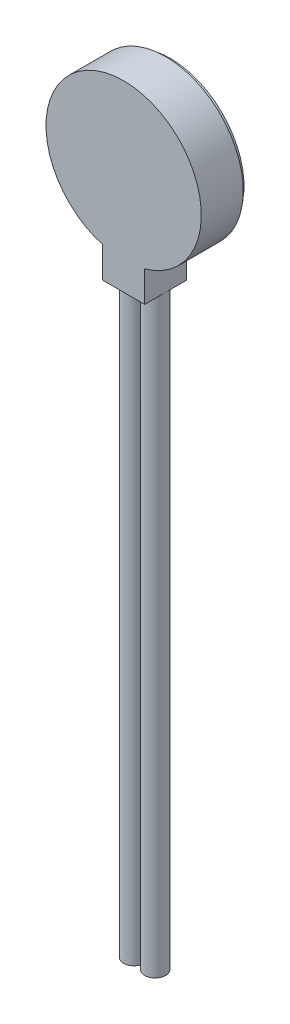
from build123d import *

# Parameters (mm, degrees)
SKETCH1_R           = 5
BOSS_EXTRUDE1_DEPTH = 2.7
SKETCH2_R           = 4.75
BOSS_EXTRUDE2_DEPTH = 0.3
SKETCH3_W           = 2.699995
SKETCH3_H           = 2.7
BOSS_EXTRUDE3_DEPTH = 6.8
SKETCH4_R           = 0.67182375
BOSS_EXTRUDE4_DEPTH = 38.1


with BuildPart() as part:
    # Sketch1 → Boss-Extrude1 (new body)
    with BuildSketch(Plane.XY):
        with Locations(Location((0, 0, 0), (0, 0, 180))):
            Circle(SKETCH1_R)
    extrude(amount=BOSS_EXTRUDE1_DEPTH)

    # Sketch2 → Boss-Extrude2 (add)
    with BuildSketch(Plane(origin=(0, 0, 0), x_dir=(-1, 0, 0), z_dir=(0, 0, -1))):
        Circle(SKETCH2_R)
    extrude(amount=BOSS_EXTRUDE2_DEPTH)

    # Sketch3 → Boss-Extrude3 (add)
    with BuildSketch(Plane(origin=(0, 0, 0), x_dir=(1, 0, 0), z_dir=(0, 1, 0))):
        with Locations((0, -1.35)):
            Rectangle(SKETCH3_W, SKETCH3_H)
    extrude(amount=-BOSS_EXTRUDE3_DEPTH)

    # Sketch4 → Boss-Extrude4 (add)
    with BuildSketch(Plane.XZ.offset(6.8)):
        with Locations(Location((-0.67817375, 1.35, 0), (0, 0, 180))):
            Circle(SKETCH4_R)
        with Locations((0.67817375, 1.35)):
            Circle(SKETCH4_R)
    extrude(amount=BOSS_EXTRUDE4_DEPTH)


solid = part.part
